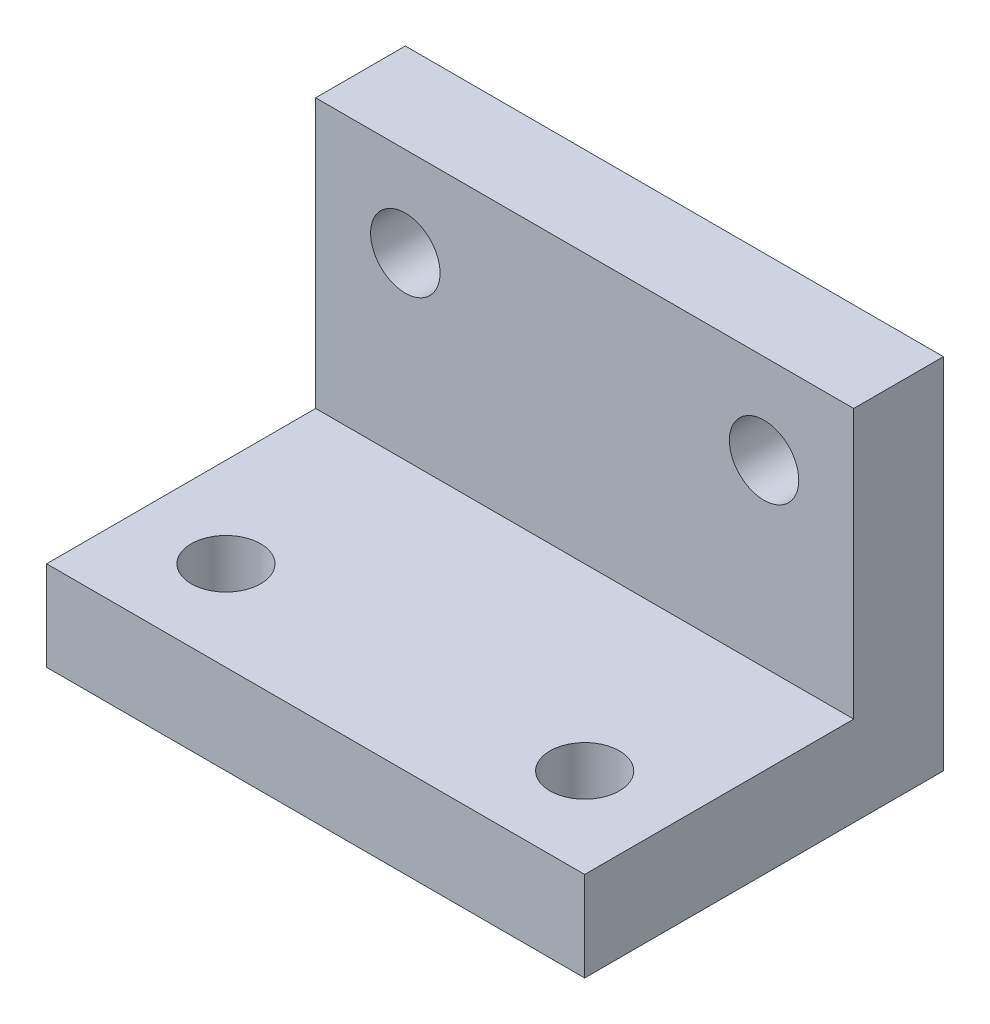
from build123d import *

# Parameters (mm, degrees)
SKETCH1_W                        = 38.1
SKETCH1_H                        = 25.4
BOSS_EXTRUDE1_DEPTH              = 12.7
CUT_EXTRUDE1_REACH               = 44.121
SKETCH2_W                        = 19.05
SKETCH2_H                        = 19.05
F_10_0_1935_DIAMETER_HOLE2_D     = 4.9149
F_10_0_1935_DIAMETER_HOLE1_D     = 4.9149
F_10_0_1935_DIAMETER_HOLE1_DEPTH = 12.7
F_10_0_1935_DIAMETER_HOLE1_TIP   = 1.476584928


with BuildPart() as part:
    # Sketch1 → Boss-Extrude1 (new, symmetric)
    with BuildSketch(Plane(origin=(0, 0, 0), x_dir=(1, 0, 0), z_dir=(0, 1, 0))):
        Rectangle(SKETCH1_W, SKETCH1_H)
    extrude(amount=BOSS_EXTRUDE1_DEPTH, both=True)

    # Sketch2 → Cut-Extrude1 (cut, up to next)
    with BuildSketch(Plane(origin=(19.05, 0, 0), x_dir=(0, 0, -1), z_dir=(1, 0, 0)), mode=Mode.PRIVATE) as cut_extrude1_sk1:
        with Locations((-3.175, 3.175)):
            Rectangle(SKETCH2_W, SKETCH2_H)
    cut_extrude1_tool1 = extrude(cut_extrude1_sk1.sketch, amount=-CUT_EXTRUDE1_REACH, mode=Mode.PRIVATE) & part.part
    add(cut_extrude1_tool1.solids().sort_by_distance((19.05, 3.175, 3.175))[0], mode=Mode.SUBTRACT)

    # 10 _0.1935_ Diameter Hole2 (through all)
    with Locations(Plane.XY.offset(-6.35)):
        with Locations((-12.7, 6.35), (12.7, 6.35)):
            Hole(F_10_0_1935_DIAMETER_HOLE2_D / 2)

    # 10 _0.1935_ Diameter Hole1
    with Locations(Plane(origin=(0, -6.35, 0), x_dir=(1, 0, 0), z_dir=(0, 1, 0))):
        with Locations((-12.7, -6.35), (12.7, -6.35)):
            Hole(F_10_0_1935_DIAMETER_HOLE1_D / 2, depth=F_10_0_1935_DIAMETER_HOLE1_DEPTH)
            with Locations((0, 0, -(F_10_0_1935_DIAMETER_HOLE1_DEPTH + F_10_0_1935_DIAMETER_HOLE1_TIP / 2))):  # 118° drill point
                Cone(0, F_10_0_1935_DIAMETER_HOLE1_D / 2, F_10_0_1935_DIAMETER_HOLE1_TIP, mode=Mode.SUBTRACT)


solid = part.part
